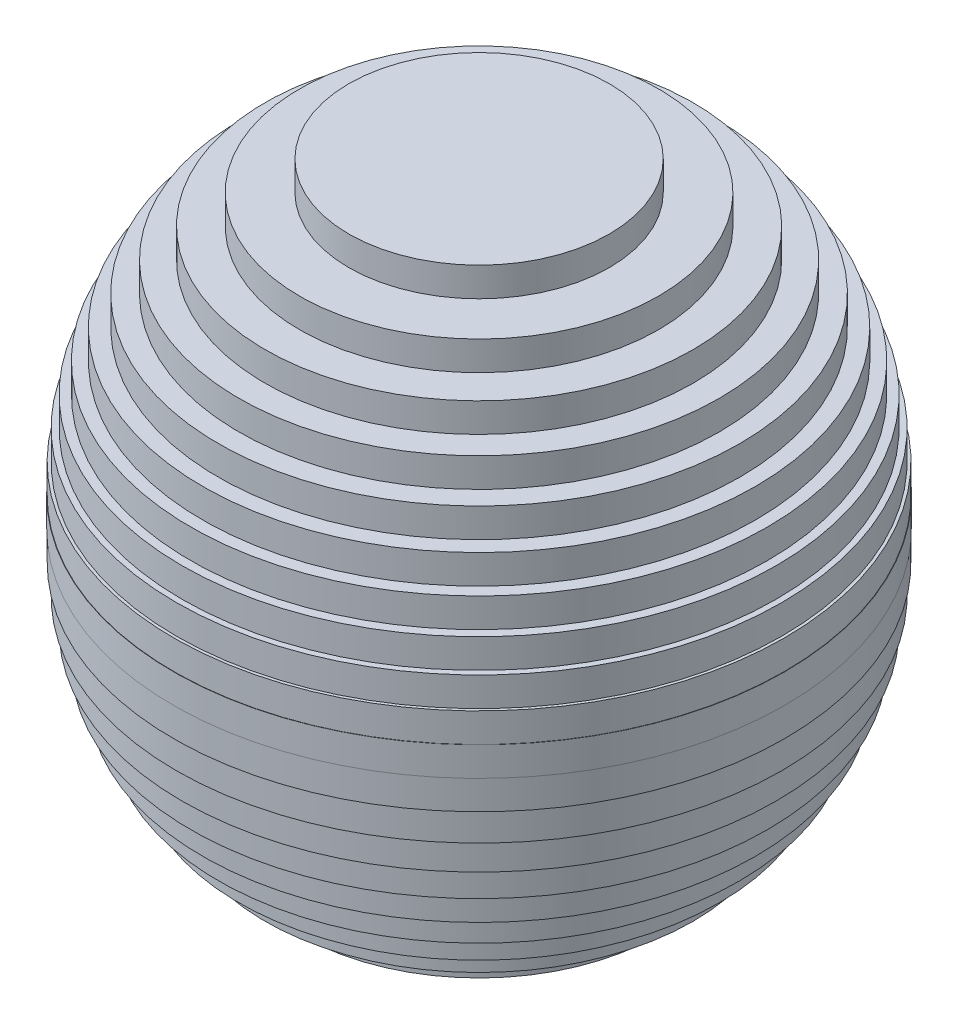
ISO-10303-21;
HEADER;
FILE_DESCRIPTION(('STEP AP214'),'2;1');
FILE_NAME('part.step','',(''),(''),'','','');
FILE_SCHEMA(('AUTOMOTIVE_DESIGN { 1 0 10303 214 1 1 1 1 }'));
ENDSEC;
DATA;
#1=APPLICATION_CONTEXT('core data for automotive mechanical design processes');
#2=APPLICATION_PROTOCOL_DEFINITION('international standard','automotive_design',2000,#1);
#3=PRODUCT_CONTEXT('',#1,'mechanical');
#4=PRODUCT('Part','Part','',(#3));
#5=PRODUCT_RELATED_PRODUCT_CATEGORY('part','',(#4));
#6=PRODUCT_DEFINITION_FORMATION('','',#4);
#7=PRODUCT_DEFINITION_CONTEXT('part definition',#1,'design');
#8=PRODUCT_DEFINITION('design','',#6,#7);
#9=PRODUCT_DEFINITION_SHAPE('','',#8);
#10=(LENGTH_UNIT() NAMED_UNIT(*) SI_UNIT(.MILLI.,.METRE.));
#11=(NAMED_UNIT(*) PLANE_ANGLE_UNIT() SI_UNIT($,.RADIAN.));
#12=(NAMED_UNIT(*) SI_UNIT($,.STERADIAN.) SOLID_ANGLE_UNIT());
#13=UNCERTAINTY_MEASURE_WITH_UNIT(LENGTH_MEASURE(1.E-05),#10,'distance_accuracy_value','');
#14=(GEOMETRIC_REPRESENTATION_CONTEXT(3) GLOBAL_UNCERTAINTY_ASSIGNED_CONTEXT((#13)) GLOBAL_UNIT_ASSIGNED_CONTEXT((#10,
#11,#12)) REPRESENTATION_CONTEXT('',''));
#15=CARTESIAN_POINT('',(0.,0.,0.));
#16=DIRECTION('',(0.,0.,1.));
#17=DIRECTION('',(1.,0.,0.));
#18=AXIS2_PLACEMENT_3D('',#15,#16,#17);
#19=CARTESIAN_POINT('',(52.4404424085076,2.49999999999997,0.));
#20=DIRECTION('',(0.,1.,0.));
#21=DIRECTION('',(-1.,0.,0.));
#22=AXIS2_PLACEMENT_3D('',#19,#20,#21);
#23=PLANE('',#22);
#24=CARTESIAN_POINT('',(0.,2.49999999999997,0.));
#25=DIRECTION('',(0.,-1.,0.));
#26=DIRECTION('',(1.,0.,0.));
#27=AXIS2_PLACEMENT_3D('',#24,#25,#26);
#28=CIRCLE('',#27,52.4404424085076);
#29=CARTESIAN_POINT('',(52.4404424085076,2.49999999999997,0.));
#30=VERTEX_POINT('',#29);
#31=EDGE_CURVE('E162',#30,#30,#28,.T.);
#32=ORIENTED_EDGE('',*,*,#31,.T.);
#33=EDGE_LOOP('',(#32));
#34=FACE_BOUND('',#33,.T.);
#35=CARTESIAN_POINT('',(0.,2.49999999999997,0.));
#36=DIRECTION('',(0.,-1.,0.));
#37=DIRECTION('',(1.,0.,0.));
#38=AXIS2_PLACEMENT_3D('',#35,#36,#37);
#39=CIRCLE('',#38,52.4999999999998);
#40=CARTESIAN_POINT('',(52.4999999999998,2.49999999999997,0.));
#41=VERTEX_POINT('',#40);
#42=EDGE_CURVE('E10',#41,#41,#39,.T.);
#43=ORIENTED_EDGE('',*,*,#42,.F.);
#44=EDGE_LOOP('',(#43));
#45=FACE_BOUND('',#44,.T.);
#46=ADVANCED_FACE('F32',(#34,#45),#23,.T.);
#47=CARTESIAN_POINT('',(0.,-52.5,0.));
#48=DIRECTION('',(0.,-1.,0.));
#49=DIRECTION('',(1.,0.,0.));
#50=AXIS2_PLACEMENT_3D('',#47,#48,#49);
#51=CYLINDRICAL_SURFACE('',#50,52.4999999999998);
#52=ORIENTED_EDGE('',*,*,#42,.T.);
#53=EDGE_LOOP('',(#52));
#54=FACE_BOUND('',#53,.T.);
#55=CARTESIAN_POINT('',(0.,-2.50000000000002,0.));
#56=DIRECTION('',(0.,-1.,0.));
#57=DIRECTION('',(1.,0.,0.));
#58=AXIS2_PLACEMENT_3D('',#55,#56,#57);
#59=CIRCLE('',#58,52.4999999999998);
#60=CARTESIAN_POINT('',(52.4999999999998,-2.50000000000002,0.));
#61=VERTEX_POINT('',#60);
#62=EDGE_CURVE('E38',#61,#61,#59,.T.);
#63=ORIENTED_EDGE('',*,*,#62,.F.);
#64=EDGE_LOOP('',(#63));
#65=FACE_BOUND('',#64,.T.);
#66=ADVANCED_FACE('F180',(#54,#65),#51,.T.);
#67=CARTESIAN_POINT('',(52.4999999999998,-2.50000000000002,0.));
#68=DIRECTION('',(0.,-1.,0.));
#69=DIRECTION('',(1.,0.,0.));
#70=AXIS2_PLACEMENT_3D('',#67,#68,#69);
#71=PLANE('',#70);
#72=ORIENTED_EDGE('',*,*,#62,.T.);
#73=EDGE_LOOP('',(#72));
#74=FACE_BOUND('',#73,.T.);
#75=CARTESIAN_POINT('',(0.,-2.50000000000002,0.));
#76=DIRECTION('',(0.,-1.,0.));
#77=DIRECTION('',(1.,0.,0.));
#78=AXIS2_PLACEMENT_3D('',#75,#76,#77);
#79=CIRCLE('',#78,52.4404424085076);
#80=CARTESIAN_POINT('',(52.4404424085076,-2.50000000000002,0.));
#81=VERTEX_POINT('',#80);
#82=EDGE_CURVE('E42',#81,#81,#79,.T.);
#83=ORIENTED_EDGE('',*,*,#82,.F.);
#84=EDGE_LOOP('',(#83));
#85=FACE_BOUND('',#84,.T.);
#86=ADVANCED_FACE('F184',(#74,#85),#71,.T.);
#87=CARTESIAN_POINT('',(0.,-52.5,0.));
#88=DIRECTION('',(0.,-1.,0.));
#89=DIRECTION('',(1.,0.,0.));
#90=AXIS2_PLACEMENT_3D('',#87,#88,#89);
#91=CYLINDRICAL_SURFACE('',#90,52.4404424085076);
#92=ORIENTED_EDGE('',*,*,#82,.T.);
#93=EDGE_LOOP('',(#92));
#94=FACE_BOUND('',#93,.T.);
#95=CARTESIAN_POINT('',(0.,-7.50000000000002,0.));
#96=DIRECTION('',(0.,-1.,0.));
#97=DIRECTION('',(1.,0.,0.));
#98=AXIS2_PLACEMENT_3D('',#95,#96,#97);
#99=CIRCLE('',#98,52.4404424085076);
#100=CARTESIAN_POINT('',(52.4404424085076,-7.50000000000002,0.));
#101=VERTEX_POINT('',#100);
#102=EDGE_CURVE('E46',#101,#101,#99,.T.);
#103=ORIENTED_EDGE('',*,*,#102,.F.);
#104=EDGE_LOOP('',(#103));
#105=FACE_BOUND('',#104,.T.);
#106=ADVANCED_FACE('F188',(#94,#105),#91,.T.);
#107=CARTESIAN_POINT('',(52.4404424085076,-7.50000000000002,0.));
#108=DIRECTION('',(0.,-1.,0.));
#109=DIRECTION('',(1.,0.,0.));
#110=AXIS2_PLACEMENT_3D('',#107,#108,#109);
#111=PLANE('',#110);
#112=ORIENTED_EDGE('',*,*,#102,.T.);
#113=EDGE_LOOP('',(#112));
#114=FACE_BOUND('',#113,.T.);
#115=CARTESIAN_POINT('',(0.,-7.50000000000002,0.));
#116=DIRECTION('',(0.,-1.,0.));
#117=DIRECTION('',(1.,0.,0.));
#118=AXIS2_PLACEMENT_3D('',#115,#116,#117);
#119=CIRCLE('',#118,51.9615242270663);
#120=CARTESIAN_POINT('',(51.9615242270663,-7.50000000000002,0.));
#121=VERTEX_POINT('',#120);
#122=EDGE_CURVE('E51',#121,#121,#119,.T.);
#123=ORIENTED_EDGE('',*,*,#122,.F.);
#124=EDGE_LOOP('',(#123));
#125=FACE_BOUND('',#124,.T.);
#126=ADVANCED_FACE('F194',(#114,#125),#111,.T.);
#127=CARTESIAN_POINT('',(0.,-52.5,0.));
#128=DIRECTION('',(0.,-1.,0.));
#129=DIRECTION('',(1.,0.,0.));
#130=AXIS2_PLACEMENT_3D('',#127,#128,#129);
#131=CYLINDRICAL_SURFACE('',#130,51.9615242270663);
#132=ORIENTED_EDGE('',*,*,#122,.T.);
#133=EDGE_LOOP('',(#132));
#134=FACE_BOUND('',#133,.T.);
#135=CARTESIAN_POINT('',(0.,-12.5,0.));
#136=DIRECTION('',(0.,-1.,0.));
#137=DIRECTION('',(1.,0.,0.));
#138=AXIS2_PLACEMENT_3D('',#135,#136,#137);
#139=CIRCLE('',#138,51.9615242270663);
#140=CARTESIAN_POINT('',(51.9615242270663,-12.5,0.));
#141=VERTEX_POINT('',#140);
#142=EDGE_CURVE('E54',#141,#141,#139,.T.);
#143=ORIENTED_EDGE('',*,*,#142,.F.);
#144=EDGE_LOOP('',(#143));
#145=FACE_BOUND('',#144,.T.);
#146=ADVANCED_FACE('F198',(#134,#145),#131,.T.);
#147=CARTESIAN_POINT('',(51.9615242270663,-12.5,0.));
#148=DIRECTION('',(0.,-1.,0.));
#149=DIRECTION('',(1.,0.,0.));
#150=AXIS2_PLACEMENT_3D('',#147,#148,#149);
#151=PLANE('',#150);
#152=ORIENTED_EDGE('',*,*,#142,.T.);
#153=EDGE_LOOP('',(#152));
#154=FACE_BOUND('',#153,.T.);
#155=CARTESIAN_POINT('',(0.,-12.5,0.));
#156=DIRECTION('',(0.,-1.,0.));
#157=DIRECTION('',(1.,0.,0.));
#158=AXIS2_PLACEMENT_3D('',#155,#156,#157);
#159=CIRCLE('',#158,50.9901951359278);
#160=CARTESIAN_POINT('',(50.9901951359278,-12.5,0.));
#161=VERTEX_POINT('',#160);
#162=EDGE_CURVE('E57',#161,#161,#159,.T.);
#163=ORIENTED_EDGE('',*,*,#162,.F.);
#164=EDGE_LOOP('',(#163));
#165=FACE_BOUND('',#164,.T.);
#166=ADVANCED_FACE('F202',(#154,#165),#151,.T.);
#167=CARTESIAN_POINT('',(0.,-52.5,0.));
#168=DIRECTION('',(0.,-1.,0.));
#169=DIRECTION('',(1.,0.,0.));
#170=AXIS2_PLACEMENT_3D('',#167,#168,#169);
#171=CYLINDRICAL_SURFACE('',#170,50.9901951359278);
#172=ORIENTED_EDGE('',*,*,#162,.T.);
#173=EDGE_LOOP('',(#172));
#174=FACE_BOUND('',#173,.T.);
#175=CARTESIAN_POINT('',(0.,-17.5,0.));
#176=DIRECTION('',(0.,-1.,0.));
#177=DIRECTION('',(1.,0.,0.));
#178=AXIS2_PLACEMENT_3D('',#175,#176,#177);
#179=CIRCLE('',#178,50.9901951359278);
#180=CARTESIAN_POINT('',(50.9901951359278,-17.5,0.));
#181=VERTEX_POINT('',#180);
#182=EDGE_CURVE('E60',#181,#181,#179,.T.);
#183=ORIENTED_EDGE('',*,*,#182,.F.);
#184=EDGE_LOOP('',(#183));
#185=FACE_BOUND('',#184,.T.);
#186=ADVANCED_FACE('F206',(#174,#185),#171,.T.);
#187=CARTESIAN_POINT('',(50.9901951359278,-17.5,0.));
#188=DIRECTION('',(0.,-1.,0.));
#189=DIRECTION('',(1.,0.,0.));
#190=AXIS2_PLACEMENT_3D('',#187,#188,#189);
#191=PLANE('',#190);
#192=ORIENTED_EDGE('',*,*,#182,.T.);
#193=EDGE_LOOP('',(#192));
#194=FACE_BOUND('',#193,.T.);
#195=CARTESIAN_POINT('',(0.,-17.5,0.));
#196=DIRECTION('',(0.,-1.,0.));
#197=DIRECTION('',(1.,0.,0.));
#198=AXIS2_PLACEMENT_3D('',#195,#196,#197);
#199=CIRCLE('',#198,49.4974746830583);
#200=CARTESIAN_POINT('',(49.4974746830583,-17.5,0.));
#201=VERTEX_POINT('',#200);
#202=EDGE_CURVE('E63',#201,#201,#199,.T.);
#203=ORIENTED_EDGE('',*,*,#202,.F.);
#204=EDGE_LOOP('',(#203));
#205=FACE_BOUND('',#204,.T.);
#206=ADVANCED_FACE('F210',(#194,#205),#191,.T.);
#207=CARTESIAN_POINT('',(0.,-52.5,0.));
#208=DIRECTION('',(0.,-1.,0.));
#209=DIRECTION('',(1.,0.,0.));
#210=AXIS2_PLACEMENT_3D('',#207,#208,#209);
#211=CYLINDRICAL_SURFACE('',#210,49.4974746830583);
#212=ORIENTED_EDGE('',*,*,#202,.T.);
#213=EDGE_LOOP('',(#212));
#214=FACE_BOUND('',#213,.T.);
#215=CARTESIAN_POINT('',(0.,-22.5,0.));
#216=DIRECTION('',(0.,-1.,0.));
#217=DIRECTION('',(1.,0.,0.));
#218=AXIS2_PLACEMENT_3D('',#215,#216,#217);
#219=CIRCLE('',#218,49.4974746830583);
#220=CARTESIAN_POINT('',(49.4974746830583,-22.5,0.));
#221=VERTEX_POINT('',#220);
#222=EDGE_CURVE('E66',#221,#221,#219,.T.);
#223=ORIENTED_EDGE('',*,*,#222,.F.);
#224=EDGE_LOOP('',(#223));
#225=FACE_BOUND('',#224,.T.);
#226=ADVANCED_FACE('F214',(#214,#225),#211,.T.);
#227=CARTESIAN_POINT('',(49.4974746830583,-22.5,0.));
#228=DIRECTION('',(0.,-1.,0.));
#229=DIRECTION('',(1.,0.,0.));
#230=AXIS2_PLACEMENT_3D('',#227,#228,#229);
#231=PLANE('',#230);
#232=ORIENTED_EDGE('',*,*,#222,.T.);
#233=EDGE_LOOP('',(#232));
#234=FACE_BOUND('',#233,.T.);
#235=CARTESIAN_POINT('',(0.,-22.5,0.));
#236=DIRECTION('',(0.,-1.,0.));
#237=DIRECTION('',(1.,0.,0.));
#238=AXIS2_PLACEMENT_3D('',#235,#236,#237);
#239=CIRCLE('',#238,47.4341649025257);
#240=CARTESIAN_POINT('',(47.4341649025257,-22.5,0.));
#241=VERTEX_POINT('',#240);
#242=EDGE_CURVE('E69',#241,#241,#239,.T.);
#243=ORIENTED_EDGE('',*,*,#242,.F.);
#244=EDGE_LOOP('',(#243));
#245=FACE_BOUND('',#244,.T.);
#246=ADVANCED_FACE('F218',(#234,#245),#231,.T.);
#247=CARTESIAN_POINT('',(0.,-52.5,0.));
#248=DIRECTION('',(0.,-1.,0.));
#249=DIRECTION('',(1.,0.,0.));
#250=AXIS2_PLACEMENT_3D('',#247,#248,#249);
#251=CYLINDRICAL_SURFACE('',#250,47.4341649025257);
#252=ORIENTED_EDGE('',*,*,#242,.T.);
#253=EDGE_LOOP('',(#252));
#254=FACE_BOUND('',#253,.T.);
#255=CARTESIAN_POINT('',(0.,-27.5,0.));
#256=DIRECTION('',(0.,-1.,0.));
#257=DIRECTION('',(1.,0.,0.));
#258=AXIS2_PLACEMENT_3D('',#255,#256,#257);
#259=CIRCLE('',#258,47.4341649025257);
#260=CARTESIAN_POINT('',(47.4341649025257,-27.5,0.));
#261=VERTEX_POINT('',#260);
#262=EDGE_CURVE('E72',#261,#261,#259,.T.);
#263=ORIENTED_EDGE('',*,*,#262,.F.);
#264=EDGE_LOOP('',(#263));
#265=FACE_BOUND('',#264,.T.);
#266=ADVANCED_FACE('F222',(#254,#265),#251,.T.);
#267=CARTESIAN_POINT('',(47.4341649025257,-27.5,0.));
#268=DIRECTION('',(0.,-1.,0.));
#269=DIRECTION('',(1.,0.,0.));
#270=AXIS2_PLACEMENT_3D('',#267,#268,#269);
#271=PLANE('',#270);
#272=ORIENTED_EDGE('',*,*,#262,.T.);
#273=EDGE_LOOP('',(#272));
#274=FACE_BOUND('',#273,.T.);
#275=CARTESIAN_POINT('',(0.,-27.5,0.));
#276=DIRECTION('',(0.,-1.,0.));
#277=DIRECTION('',(1.,0.,0.));
#278=AXIS2_PLACEMENT_3D('',#275,#276,#277);
#279=CIRCLE('',#278,44.7213595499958);
#280=CARTESIAN_POINT('',(44.7213595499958,-27.5,0.));
#281=VERTEX_POINT('',#280);
#282=EDGE_CURVE('E75',#281,#281,#279,.T.);
#283=ORIENTED_EDGE('',*,*,#282,.F.);
#284=EDGE_LOOP('',(#283));
#285=FACE_BOUND('',#284,.T.);
#286=ADVANCED_FACE('F226',(#274,#285),#271,.T.);
#287=CARTESIAN_POINT('',(0.,-52.5,0.));
#288=DIRECTION('',(0.,-1.,0.));
#289=DIRECTION('',(1.,0.,0.));
#290=AXIS2_PLACEMENT_3D('',#287,#288,#289);
#291=CYLINDRICAL_SURFACE('',#290,44.7213595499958);
#292=ORIENTED_EDGE('',*,*,#282,.T.);
#293=EDGE_LOOP('',(#292));
#294=FACE_BOUND('',#293,.T.);
#295=CARTESIAN_POINT('',(0.,-32.5,0.));
#296=DIRECTION('',(0.,-1.,0.));
#297=DIRECTION('',(1.,0.,0.));
#298=AXIS2_PLACEMENT_3D('',#295,#296,#297);
#299=CIRCLE('',#298,44.7213595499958);
#300=CARTESIAN_POINT('',(44.7213595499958,-32.5,0.));
#301=VERTEX_POINT('',#300);
#302=EDGE_CURVE('E78',#301,#301,#299,.T.);
#303=ORIENTED_EDGE('',*,*,#302,.F.);
#304=EDGE_LOOP('',(#303));
#305=FACE_BOUND('',#304,.T.);
#306=ADVANCED_FACE('F230',(#294,#305),#291,.T.);
#307=CARTESIAN_POINT('',(44.7213595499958,-32.5,0.));
#308=DIRECTION('',(0.,-1.,0.));
#309=DIRECTION('',(1.,0.,0.));
#310=AXIS2_PLACEMENT_3D('',#307,#308,#309);
#311=PLANE('',#310);
#312=ORIENTED_EDGE('',*,*,#302,.T.);
#313=EDGE_LOOP('',(#312));
#314=FACE_BOUND('',#313,.T.);
#315=CARTESIAN_POINT('',(0.,-32.5,0.));
#316=DIRECTION('',(0.,-1.,0.));
#317=DIRECTION('',(1.,0.,0.));
#318=AXIS2_PLACEMENT_3D('',#315,#316,#317);
#319=CIRCLE('',#318,41.2310562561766);
#320=CARTESIAN_POINT('',(41.2310562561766,-32.5,0.));
#321=VERTEX_POINT('',#320);
#322=EDGE_CURVE('E81',#321,#321,#319,.T.);
#323=ORIENTED_EDGE('',*,*,#322,.F.);
#324=EDGE_LOOP('',(#323));
#325=FACE_BOUND('',#324,.T.);
#326=ADVANCED_FACE('F234',(#314,#325),#311,.T.);
#327=CARTESIAN_POINT('',(0.,-52.5,0.));
#328=DIRECTION('',(0.,-1.,0.));
#329=DIRECTION('',(1.,0.,0.));
#330=AXIS2_PLACEMENT_3D('',#327,#328,#329);
#331=CYLINDRICAL_SURFACE('',#330,41.2310562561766);
#332=ORIENTED_EDGE('',*,*,#322,.T.);
#333=EDGE_LOOP('',(#332));
#334=FACE_BOUND('',#333,.T.);
#335=CARTESIAN_POINT('',(0.,-37.5,0.));
#336=DIRECTION('',(0.,-1.,0.));
#337=DIRECTION('',(1.,0.,0.));
#338=AXIS2_PLACEMENT_3D('',#335,#336,#337);
#339=CIRCLE('',#338,41.2310562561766);
#340=CARTESIAN_POINT('',(41.2310562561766,-37.5,0.));
#341=VERTEX_POINT('',#340);
#342=EDGE_CURVE('E84',#341,#341,#339,.T.);
#343=ORIENTED_EDGE('',*,*,#342,.F.);
#344=EDGE_LOOP('',(#343));
#345=FACE_BOUND('',#344,.T.);
#346=ADVANCED_FACE('F238',(#334,#345),#331,.T.);
#347=CARTESIAN_POINT('',(41.2310562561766,-37.5,0.));
#348=DIRECTION('',(0.,-1.,0.));
#349=DIRECTION('',(1.,0.,0.));
#350=AXIS2_PLACEMENT_3D('',#347,#348,#349);
#351=PLANE('',#350);
#352=ORIENTED_EDGE('',*,*,#342,.T.);
#353=EDGE_LOOP('',(#352));
#354=FACE_BOUND('',#353,.T.);
#355=CARTESIAN_POINT('',(0.,-37.5,0.));
#356=DIRECTION('',(0.,-1.,0.));
#357=DIRECTION('',(1.,0.,0.));
#358=AXIS2_PLACEMENT_3D('',#355,#356,#357);
#359=CIRCLE('',#358,36.7423461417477);
#360=CARTESIAN_POINT('',(36.7423461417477,-37.5,0.));
#361=VERTEX_POINT('',#360);
#362=EDGE_CURVE('E87',#361,#361,#359,.T.);
#363=ORIENTED_EDGE('',*,*,#362,.F.);
#364=EDGE_LOOP('',(#363));
#365=FACE_BOUND('',#364,.T.);
#366=ADVANCED_FACE('F242',(#354,#365),#351,.T.);
#367=CARTESIAN_POINT('',(0.,-52.5,0.));
#368=DIRECTION('',(0.,-1.,0.));
#369=DIRECTION('',(1.,0.,0.));
#370=AXIS2_PLACEMENT_3D('',#367,#368,#369);
#371=CYLINDRICAL_SURFACE('',#370,36.7423461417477);
#372=ORIENTED_EDGE('',*,*,#362,.T.);
#373=EDGE_LOOP('',(#372));
#374=FACE_BOUND('',#373,.T.);
#375=CARTESIAN_POINT('',(0.,-42.5,0.));
#376=DIRECTION('',(0.,-1.,0.));
#377=DIRECTION('',(1.,0.,0.));
#378=AXIS2_PLACEMENT_3D('',#375,#376,#377);
#379=CIRCLE('',#378,36.7423461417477);
#380=CARTESIAN_POINT('',(36.7423461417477,-42.5,0.));
#381=VERTEX_POINT('',#380);
#382=EDGE_CURVE('E90',#381,#381,#379,.T.);
#383=ORIENTED_EDGE('',*,*,#382,.F.);
#384=EDGE_LOOP('',(#383));
#385=FACE_BOUND('',#384,.T.);
#386=ADVANCED_FACE('F246',(#374,#385),#371,.T.);
#387=CARTESIAN_POINT('',(36.7423461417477,-42.5,0.));
#388=DIRECTION('',(0.,-1.,0.));
#389=DIRECTION('',(1.,0.,0.));
#390=AXIS2_PLACEMENT_3D('',#387,#388,#389);
#391=PLANE('',#390);
#392=ORIENTED_EDGE('',*,*,#382,.T.);
#393=EDGE_LOOP('',(#392));
#394=FACE_BOUND('',#393,.T.);
#395=CARTESIAN_POINT('',(0.,-42.5,0.));
#396=DIRECTION('',(0.,-1.,0.));
#397=DIRECTION('',(1.,0.,0.));
#398=AXIS2_PLACEMENT_3D('',#395,#396,#397);
#399=CIRCLE('',#398,30.8220700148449);
#400=CARTESIAN_POINT('',(30.8220700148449,-42.5,0.));
#401=VERTEX_POINT('',#400);
#402=EDGE_CURVE('E93',#401,#401,#399,.T.);
#403=ORIENTED_EDGE('',*,*,#402,.F.);
#404=EDGE_LOOP('',(#403));
#405=FACE_BOUND('',#404,.T.);
#406=ADVANCED_FACE('F250',(#394,#405),#391,.T.);
#407=CARTESIAN_POINT('',(0.,-52.5,0.));
#408=DIRECTION('',(0.,-1.,0.));
#409=DIRECTION('',(1.,0.,0.));
#410=AXIS2_PLACEMENT_3D('',#407,#408,#409);
#411=CYLINDRICAL_SURFACE('',#410,30.8220700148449);
#412=ORIENTED_EDGE('',*,*,#402,.T.);
#413=EDGE_LOOP('',(#412));
#414=FACE_BOUND('',#413,.T.);
#415=CARTESIAN_POINT('',(0.,-47.5,0.));
#416=DIRECTION('',(0.,-1.,0.));
#417=DIRECTION('',(1.,0.,0.));
#418=AXIS2_PLACEMENT_3D('',#415,#416,#417);
#419=CIRCLE('',#418,30.8220700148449);
#420=CARTESIAN_POINT('',(30.8220700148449,-47.5,0.));
#421=VERTEX_POINT('',#420);
#422=EDGE_CURVE('E96',#421,#421,#419,.T.);
#423=ORIENTED_EDGE('',*,*,#422,.F.);
#424=EDGE_LOOP('',(#423));
#425=FACE_BOUND('',#424,.T.);
#426=ADVANCED_FACE('F254',(#414,#425),#411,.T.);
#427=CARTESIAN_POINT('',(30.8220700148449,-47.5,0.));
#428=DIRECTION('',(0.,-1.,0.));
#429=DIRECTION('',(1.,0.,0.));
#430=AXIS2_PLACEMENT_3D('',#427,#428,#429);
#431=PLANE('',#430);
#432=ORIENTED_EDGE('',*,*,#422,.T.);
#433=EDGE_LOOP('',(#432));
#434=FACE_BOUND('',#433,.T.);
#435=CARTESIAN_POINT('',(0.,-47.5,0.));
#436=DIRECTION('',(0.,-1.,0.));
#437=DIRECTION('',(1.,0.,0.));
#438=AXIS2_PLACEMENT_3D('',#435,#436,#437);
#439=CIRCLE('',#438,22.3606797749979);
#440=CARTESIAN_POINT('',(22.3606797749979,-47.5,0.));
#441=VERTEX_POINT('',#440);
#442=EDGE_CURVE('E99',#441,#441,#439,.T.);
#443=ORIENTED_EDGE('',*,*,#442,.F.);
#444=EDGE_LOOP('',(#443));
#445=FACE_BOUND('',#444,.T.);
#446=ADVANCED_FACE('F258',(#434,#445),#431,.T.);
#447=CARTESIAN_POINT('',(0.,-52.5,0.));
#448=DIRECTION('',(0.,-1.,0.));
#449=DIRECTION('',(1.,0.,0.));
#450=AXIS2_PLACEMENT_3D('',#447,#448,#449);
#451=CYLINDRICAL_SURFACE('',#450,22.3606797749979);
#452=ORIENTED_EDGE('',*,*,#442,.T.);
#453=EDGE_LOOP('',(#452));
#454=FACE_BOUND('',#453,.T.);
#455=CARTESIAN_POINT('',(0.,-52.5,0.));
#456=DIRECTION('',(0.,-1.,0.));
#457=DIRECTION('',(1.,0.,0.));
#458=AXIS2_PLACEMENT_3D('',#455,#456,#457);
#459=CIRCLE('',#458,22.3606797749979);
#460=CARTESIAN_POINT('',(22.3606797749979,-52.5,0.));
#461=VERTEX_POINT('',#460);
#462=EDGE_CURVE('E102',#461,#461,#459,.T.);
#463=ORIENTED_EDGE('',*,*,#462,.F.);
#464=EDGE_LOOP('',(#463));
#465=FACE_BOUND('',#464,.T.);
#466=ADVANCED_FACE('F262',(#454,#465),#451,.T.);
#467=CARTESIAN_POINT('',(22.3606797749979,-52.5,0.));
#468=DIRECTION('',(0.,-1.,0.));
#469=DIRECTION('',(1.,0.,0.));
#470=AXIS2_PLACEMENT_3D('',#467,#468,#469);
#471=PLANE('',#470);
#472=ORIENTED_EDGE('',*,*,#462,.T.);
#473=EDGE_LOOP('',(#472));
#474=FACE_BOUND('',#473,.T.);
#475=ADVANCED_FACE('F266',(#474),#471,.T.);
#476=CARTESIAN_POINT('',(0.,52.5,0.));
#477=DIRECTION('',(0.,1.,0.));
#478=DIRECTION('',(-1.,0.,0.));
#479=AXIS2_PLACEMENT_3D('',#476,#477,#478);
#480=PLANE('',#479);
#481=CARTESIAN_POINT('',(0.,52.5,0.));
#482=DIRECTION('',(0.,-1.,0.));
#483=DIRECTION('',(1.,0.,0.));
#484=AXIS2_PLACEMENT_3D('',#481,#482,#483);
#485=CIRCLE('',#484,22.3606797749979);
#486=CARTESIAN_POINT('',(22.3606797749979,52.5,0.));
#487=VERTEX_POINT('',#486);
#488=EDGE_CURVE('E105',#487,#487,#485,.T.);
#489=ORIENTED_EDGE('',*,*,#488,.F.);
#490=EDGE_LOOP('',(#489));
#491=FACE_BOUND('',#490,.T.);
#492=ADVANCED_FACE('F270',(#491),#480,.T.);
#493=CARTESIAN_POINT('',(0.,-52.5,0.));
#494=DIRECTION('',(0.,-1.,0.));
#495=DIRECTION('',(1.,0.,0.));
#496=AXIS2_PLACEMENT_3D('',#493,#494,#495);
#497=CYLINDRICAL_SURFACE('',#496,22.3606797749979);
#498=ORIENTED_EDGE('',*,*,#488,.T.);
#499=EDGE_LOOP('',(#498));
#500=FACE_BOUND('',#499,.T.);
#501=CARTESIAN_POINT('',(0.,47.5,0.));
#502=DIRECTION('',(0.,-1.,0.));
#503=DIRECTION('',(1.,0.,0.));
#504=AXIS2_PLACEMENT_3D('',#501,#502,#503);
#505=CIRCLE('',#504,22.360679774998);
#506=CARTESIAN_POINT('',(22.360679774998,47.5,0.));
#507=VERTEX_POINT('',#506);
#508=EDGE_CURVE('E108',#507,#507,#505,.T.);
#509=ORIENTED_EDGE('',*,*,#508,.F.);
#510=EDGE_LOOP('',(#509));
#511=FACE_BOUND('',#510,.T.);
#512=ADVANCED_FACE('F274',(#500,#511),#497,.T.);
#513=CARTESIAN_POINT('',(22.360679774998,47.5,0.));
#514=DIRECTION('',(0.,1.,0.));
#515=DIRECTION('',(-1.,0.,0.));
#516=AXIS2_PLACEMENT_3D('',#513,#514,#515);
#517=PLANE('',#516);
#518=ORIENTED_EDGE('',*,*,#508,.T.);
#519=EDGE_LOOP('',(#518));
#520=FACE_BOUND('',#519,.T.);
#521=CARTESIAN_POINT('',(0.,47.5,0.));
#522=DIRECTION('',(0.,-1.,0.));
#523=DIRECTION('',(1.,0.,0.));
#524=AXIS2_PLACEMENT_3D('',#521,#522,#523);
#525=CIRCLE('',#524,30.8220700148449);
#526=CARTESIAN_POINT('',(30.8220700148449,47.5,0.));
#527=VERTEX_POINT('',#526);
#528=EDGE_CURVE('E111',#527,#527,#525,.T.);
#529=ORIENTED_EDGE('',*,*,#528,.F.);
#530=EDGE_LOOP('',(#529));
#531=FACE_BOUND('',#530,.T.);
#532=ADVANCED_FACE('F278',(#520,#531),#517,.T.);
#533=CARTESIAN_POINT('',(0.,-52.5,0.));
#534=DIRECTION('',(0.,-1.,0.));
#535=DIRECTION('',(1.,0.,0.));
#536=AXIS2_PLACEMENT_3D('',#533,#534,#535);
#537=CYLINDRICAL_SURFACE('',#536,30.8220700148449);
#538=ORIENTED_EDGE('',*,*,#528,.T.);
#539=EDGE_LOOP('',(#538));
#540=FACE_BOUND('',#539,.T.);
#541=CARTESIAN_POINT('',(0.,42.5,0.));
#542=DIRECTION('',(0.,-1.,0.));
#543=DIRECTION('',(1.,0.,0.));
#544=AXIS2_PLACEMENT_3D('',#541,#542,#543);
#545=CIRCLE('',#544,30.8220700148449);
#546=CARTESIAN_POINT('',(30.8220700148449,42.5,0.));
#547=VERTEX_POINT('',#546);
#548=EDGE_CURVE('E114',#547,#547,#545,.T.);
#549=ORIENTED_EDGE('',*,*,#548,.F.);
#550=EDGE_LOOP('',(#549));
#551=FACE_BOUND('',#550,.T.);
#552=ADVANCED_FACE('F282',(#540,#551),#537,.T.);
#553=CARTESIAN_POINT('',(30.8220700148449,42.5,0.));
#554=DIRECTION('',(0.,1.,0.));
#555=DIRECTION('',(-1.,0.,0.));
#556=AXIS2_PLACEMENT_3D('',#553,#554,#555);
#557=PLANE('',#556);
#558=ORIENTED_EDGE('',*,*,#548,.T.);
#559=EDGE_LOOP('',(#558));
#560=FACE_BOUND('',#559,.T.);
#561=CARTESIAN_POINT('',(0.,42.5,0.));
#562=DIRECTION('',(0.,-1.,0.));
#563=DIRECTION('',(1.,0.,0.));
#564=AXIS2_PLACEMENT_3D('',#561,#562,#563);
#565=CIRCLE('',#564,36.7423461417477);
#566=CARTESIAN_POINT('',(36.7423461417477,42.5,0.));
#567=VERTEX_POINT('',#566);
#568=EDGE_CURVE('E117',#567,#567,#565,.T.);
#569=ORIENTED_EDGE('',*,*,#568,.F.);
#570=EDGE_LOOP('',(#569));
#571=FACE_BOUND('',#570,.T.);
#572=ADVANCED_FACE('F286',(#560,#571),#557,.T.);
#573=CARTESIAN_POINT('',(0.,-52.5,0.));
#574=DIRECTION('',(0.,-1.,0.));
#575=DIRECTION('',(1.,0.,0.));
#576=AXIS2_PLACEMENT_3D('',#573,#574,#575);
#577=CYLINDRICAL_SURFACE('',#576,36.7423461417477);
#578=ORIENTED_EDGE('',*,*,#568,.T.);
#579=EDGE_LOOP('',(#578));
#580=FACE_BOUND('',#579,.T.);
#581=CARTESIAN_POINT('',(0.,37.5,0.));
#582=DIRECTION('',(0.,-1.,0.));
#583=DIRECTION('',(1.,0.,0.));
#584=AXIS2_PLACEMENT_3D('',#581,#582,#583);
#585=CIRCLE('',#584,36.7423461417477);
#586=CARTESIAN_POINT('',(36.7423461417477,37.5,0.));
#587=VERTEX_POINT('',#586);
#588=EDGE_CURVE('E120',#587,#587,#585,.T.);
#589=ORIENTED_EDGE('',*,*,#588,.F.);
#590=EDGE_LOOP('',(#589));
#591=FACE_BOUND('',#590,.T.);
#592=ADVANCED_FACE('F290',(#580,#591),#577,.T.);
#593=CARTESIAN_POINT('',(36.7423461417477,37.5,0.));
#594=DIRECTION('',(0.,1.,0.));
#595=DIRECTION('',(-1.,0.,0.));
#596=AXIS2_PLACEMENT_3D('',#593,#594,#595);
#597=PLANE('',#596);
#598=ORIENTED_EDGE('',*,*,#588,.T.);
#599=EDGE_LOOP('',(#598));
#600=FACE_BOUND('',#599,.T.);
#601=CARTESIAN_POINT('',(0.,37.5,0.));
#602=DIRECTION('',(0.,-1.,0.));
#603=DIRECTION('',(1.,0.,0.));
#604=AXIS2_PLACEMENT_3D('',#601,#602,#603);
#605=CIRCLE('',#604,41.2310562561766);
#606=CARTESIAN_POINT('',(41.2310562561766,37.5,0.));
#607=VERTEX_POINT('',#606);
#608=EDGE_CURVE('E123',#607,#607,#605,.T.);
#609=ORIENTED_EDGE('',*,*,#608,.F.);
#610=EDGE_LOOP('',(#609));
#611=FACE_BOUND('',#610,.T.);
#612=ADVANCED_FACE('F294',(#600,#611),#597,.T.);
#613=CARTESIAN_POINT('',(0.,-52.5,0.));
#614=DIRECTION('',(0.,-1.,0.));
#615=DIRECTION('',(1.,0.,0.));
#616=AXIS2_PLACEMENT_3D('',#613,#614,#615);
#617=CYLINDRICAL_SURFACE('',#616,41.2310562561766);
#618=ORIENTED_EDGE('',*,*,#608,.T.);
#619=EDGE_LOOP('',(#618));
#620=FACE_BOUND('',#619,.T.);
#621=CARTESIAN_POINT('',(0.,32.5,0.));
#622=DIRECTION('',(0.,-1.,0.));
#623=DIRECTION('',(1.,0.,0.));
#624=AXIS2_PLACEMENT_3D('',#621,#622,#623);
#625=CIRCLE('',#624,41.2310562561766);
#626=CARTESIAN_POINT('',(41.2310562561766,32.5,0.));
#627=VERTEX_POINT('',#626);
#628=EDGE_CURVE('E126',#627,#627,#625,.T.);
#629=ORIENTED_EDGE('',*,*,#628,.F.);
#630=EDGE_LOOP('',(#629));
#631=FACE_BOUND('',#630,.T.);
#632=ADVANCED_FACE('F298',(#620,#631),#617,.T.);
#633=CARTESIAN_POINT('',(41.2310562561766,32.5,0.));
#634=DIRECTION('',(0.,1.,0.));
#635=DIRECTION('',(-1.,0.,0.));
#636=AXIS2_PLACEMENT_3D('',#633,#634,#635);
#637=PLANE('',#636);
#638=ORIENTED_EDGE('',*,*,#628,.T.);
#639=EDGE_LOOP('',(#638));
#640=FACE_BOUND('',#639,.T.);
#641=CARTESIAN_POINT('',(0.,32.5,0.));
#642=DIRECTION('',(0.,-1.,0.));
#643=DIRECTION('',(1.,0.,0.));
#644=AXIS2_PLACEMENT_3D('',#641,#642,#643);
#645=CIRCLE('',#644,44.7213595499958);
#646=CARTESIAN_POINT('',(44.7213595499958,32.5,0.));
#647=VERTEX_POINT('',#646);
#648=EDGE_CURVE('E129',#647,#647,#645,.T.);
#649=ORIENTED_EDGE('',*,*,#648,.F.);
#650=EDGE_LOOP('',(#649));
#651=FACE_BOUND('',#650,.T.);
#652=ADVANCED_FACE('F302',(#640,#651),#637,.T.);
#653=CARTESIAN_POINT('',(0.,-52.5,0.));
#654=DIRECTION('',(0.,-1.,0.));
#655=DIRECTION('',(1.,0.,0.));
#656=AXIS2_PLACEMENT_3D('',#653,#654,#655);
#657=CYLINDRICAL_SURFACE('',#656,44.7213595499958);
#658=ORIENTED_EDGE('',*,*,#648,.T.);
#659=EDGE_LOOP('',(#658));
#660=FACE_BOUND('',#659,.T.);
#661=CARTESIAN_POINT('',(0.,27.5,0.));
#662=DIRECTION('',(0.,-1.,0.));
#663=DIRECTION('',(1.,0.,0.));
#664=AXIS2_PLACEMENT_3D('',#661,#662,#663);
#665=CIRCLE('',#664,44.7213595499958);
#666=CARTESIAN_POINT('',(44.7213595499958,27.5,0.));
#667=VERTEX_POINT('',#666);
#668=EDGE_CURVE('E132',#667,#667,#665,.T.);
#669=ORIENTED_EDGE('',*,*,#668,.F.);
#670=EDGE_LOOP('',(#669));
#671=FACE_BOUND('',#670,.T.);
#672=ADVANCED_FACE('F306',(#660,#671),#657,.T.);
#673=CARTESIAN_POINT('',(44.7213595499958,27.5,0.));
#674=DIRECTION('',(0.,1.,0.));
#675=DIRECTION('',(-1.,0.,0.));
#676=AXIS2_PLACEMENT_3D('',#673,#674,#675);
#677=PLANE('',#676);
#678=ORIENTED_EDGE('',*,*,#668,.T.);
#679=EDGE_LOOP('',(#678));
#680=FACE_BOUND('',#679,.T.);
#681=CARTESIAN_POINT('',(0.,27.5,0.));
#682=DIRECTION('',(0.,-1.,0.));
#683=DIRECTION('',(1.,0.,0.));
#684=AXIS2_PLACEMENT_3D('',#681,#682,#683);
#685=CIRCLE('',#684,47.4341649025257);
#686=CARTESIAN_POINT('',(47.4341649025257,27.5,0.));
#687=VERTEX_POINT('',#686);
#688=EDGE_CURVE('E135',#687,#687,#685,.T.);
#689=ORIENTED_EDGE('',*,*,#688,.F.);
#690=EDGE_LOOP('',(#689));
#691=FACE_BOUND('',#690,.T.);
#692=ADVANCED_FACE('F310',(#680,#691),#677,.T.);
#693=CARTESIAN_POINT('',(0.,-52.5,0.));
#694=DIRECTION('',(0.,-1.,0.));
#695=DIRECTION('',(1.,0.,0.));
#696=AXIS2_PLACEMENT_3D('',#693,#694,#695);
#697=CYLINDRICAL_SURFACE('',#696,47.4341649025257);
#698=ORIENTED_EDGE('',*,*,#688,.T.);
#699=EDGE_LOOP('',(#698));
#700=FACE_BOUND('',#699,.T.);
#701=CARTESIAN_POINT('',(0.,22.5,0.));
#702=DIRECTION('',(0.,-1.,0.));
#703=DIRECTION('',(1.,0.,0.));
#704=AXIS2_PLACEMENT_3D('',#701,#702,#703);
#705=CIRCLE('',#704,47.4341649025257);
#706=CARTESIAN_POINT('',(47.4341649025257,22.5,0.));
#707=VERTEX_POINT('',#706);
#708=EDGE_CURVE('E138',#707,#707,#705,.T.);
#709=ORIENTED_EDGE('',*,*,#708,.F.);
#710=EDGE_LOOP('',(#709));
#711=FACE_BOUND('',#710,.T.);
#712=ADVANCED_FACE('F314',(#700,#711),#697,.T.);
#713=CARTESIAN_POINT('',(47.4341649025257,22.5,0.));
#714=DIRECTION('',(0.,1.,0.));
#715=DIRECTION('',(-1.,0.,0.));
#716=AXIS2_PLACEMENT_3D('',#713,#714,#715);
#717=PLANE('',#716);
#718=ORIENTED_EDGE('',*,*,#708,.T.);
#719=EDGE_LOOP('',(#718));
#720=FACE_BOUND('',#719,.T.);
#721=CARTESIAN_POINT('',(0.,22.5,0.));
#722=DIRECTION('',(0.,-1.,0.));
#723=DIRECTION('',(1.,0.,0.));
#724=AXIS2_PLACEMENT_3D('',#721,#722,#723);
#725=CIRCLE('',#724,49.4974746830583);
#726=CARTESIAN_POINT('',(49.4974746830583,22.5,0.));
#727=VERTEX_POINT('',#726);
#728=EDGE_CURVE('E141',#727,#727,#725,.T.);
#729=ORIENTED_EDGE('',*,*,#728,.F.);
#730=EDGE_LOOP('',(#729));
#731=FACE_BOUND('',#730,.T.);
#732=ADVANCED_FACE('F318',(#720,#731),#717,.T.);
#733=CARTESIAN_POINT('',(0.,-52.5,0.));
#734=DIRECTION('',(0.,-1.,0.));
#735=DIRECTION('',(1.,0.,0.));
#736=AXIS2_PLACEMENT_3D('',#733,#734,#735);
#737=CYLINDRICAL_SURFACE('',#736,49.4974746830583);
#738=ORIENTED_EDGE('',*,*,#728,.T.);
#739=EDGE_LOOP('',(#738));
#740=FACE_BOUND('',#739,.T.);
#741=CARTESIAN_POINT('',(0.,17.5,0.));
#742=DIRECTION('',(0.,-1.,0.));
#743=DIRECTION('',(1.,0.,0.));
#744=AXIS2_PLACEMENT_3D('',#741,#742,#743);
#745=CIRCLE('',#744,49.4974746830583);
#746=CARTESIAN_POINT('',(49.4974746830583,17.5,0.));
#747=VERTEX_POINT('',#746);
#748=EDGE_CURVE('E144',#747,#747,#745,.T.);
#749=ORIENTED_EDGE('',*,*,#748,.F.);
#750=EDGE_LOOP('',(#749));
#751=FACE_BOUND('',#750,.T.);
#752=ADVANCED_FACE('F322',(#740,#751),#737,.T.);
#753=CARTESIAN_POINT('',(49.4974746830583,17.5,0.));
#754=DIRECTION('',(0.,1.,0.));
#755=DIRECTION('',(-1.,0.,0.));
#756=AXIS2_PLACEMENT_3D('',#753,#754,#755);
#757=PLANE('',#756);
#758=ORIENTED_EDGE('',*,*,#748,.T.);
#759=EDGE_LOOP('',(#758));
#760=FACE_BOUND('',#759,.T.);
#761=CARTESIAN_POINT('',(0.,17.5,0.));
#762=DIRECTION('',(0.,-1.,0.));
#763=DIRECTION('',(1.,0.,0.));
#764=AXIS2_PLACEMENT_3D('',#761,#762,#763);
#765=CIRCLE('',#764,50.9901951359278);
#766=CARTESIAN_POINT('',(50.9901951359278,17.5,0.));
#767=VERTEX_POINT('',#766);
#768=EDGE_CURVE('E147',#767,#767,#765,.T.);
#769=ORIENTED_EDGE('',*,*,#768,.F.);
#770=EDGE_LOOP('',(#769));
#771=FACE_BOUND('',#770,.T.);
#772=ADVANCED_FACE('F326',(#760,#771),#757,.T.);
#773=CARTESIAN_POINT('',(0.,-52.5,0.));
#774=DIRECTION('',(0.,-1.,0.));
#775=DIRECTION('',(1.,0.,0.));
#776=AXIS2_PLACEMENT_3D('',#773,#774,#775);
#777=CYLINDRICAL_SURFACE('',#776,50.9901951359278);
#778=ORIENTED_EDGE('',*,*,#768,.T.);
#779=EDGE_LOOP('',(#778));
#780=FACE_BOUND('',#779,.T.);
#781=CARTESIAN_POINT('',(0.,12.5,0.));
#782=DIRECTION('',(0.,-1.,0.));
#783=DIRECTION('',(1.,0.,0.));
#784=AXIS2_PLACEMENT_3D('',#781,#782,#783);
#785=CIRCLE('',#784,50.9901951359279);
#786=CARTESIAN_POINT('',(50.9901951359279,12.5,0.));
#787=VERTEX_POINT('',#786);
#788=EDGE_CURVE('E150',#787,#787,#785,.T.);
#789=ORIENTED_EDGE('',*,*,#788,.F.);
#790=EDGE_LOOP('',(#789));
#791=FACE_BOUND('',#790,.T.);
#792=ADVANCED_FACE('F330',(#780,#791),#777,.T.);
#793=CARTESIAN_POINT('',(50.9901951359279,12.5,0.));
#794=DIRECTION('',(0.,1.,0.));
#795=DIRECTION('',(-1.,0.,0.));
#796=AXIS2_PLACEMENT_3D('',#793,#794,#795);
#797=PLANE('',#796);
#798=ORIENTED_EDGE('',*,*,#788,.T.);
#799=EDGE_LOOP('',(#798));
#800=FACE_BOUND('',#799,.T.);
#801=CARTESIAN_POINT('',(0.,12.5,0.));
#802=DIRECTION('',(0.,-1.,0.));
#803=DIRECTION('',(1.,0.,0.));
#804=AXIS2_PLACEMENT_3D('',#801,#802,#803);
#805=CIRCLE('',#804,51.9615242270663);
#806=CARTESIAN_POINT('',(51.9615242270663,12.5,0.));
#807=VERTEX_POINT('',#806);
#808=EDGE_CURVE('E153',#807,#807,#805,.T.);
#809=ORIENTED_EDGE('',*,*,#808,.F.);
#810=EDGE_LOOP('',(#809));
#811=FACE_BOUND('',#810,.T.);
#812=ADVANCED_FACE('F334',(#800,#811),#797,.T.);
#813=CARTESIAN_POINT('',(0.,-52.5,0.));
#814=DIRECTION('',(0.,-1.,0.));
#815=DIRECTION('',(1.,0.,0.));
#816=AXIS2_PLACEMENT_3D('',#813,#814,#815);
#817=CYLINDRICAL_SURFACE('',#816,51.9615242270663);
#818=ORIENTED_EDGE('',*,*,#808,.T.);
#819=EDGE_LOOP('',(#818));
#820=FACE_BOUND('',#819,.T.);
#821=CARTESIAN_POINT('',(0.,7.49999999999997,0.));
#822=DIRECTION('',(0.,-1.,0.));
#823=DIRECTION('',(1.,0.,0.));
#824=AXIS2_PLACEMENT_3D('',#821,#822,#823);
#825=CIRCLE('',#824,51.9615242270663);
#826=CARTESIAN_POINT('',(51.9615242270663,7.49999999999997,0.));
#827=VERTEX_POINT('',#826);
#828=EDGE_CURVE('E156',#827,#827,#825,.T.);
#829=ORIENTED_EDGE('',*,*,#828,.F.);
#830=EDGE_LOOP('',(#829));
#831=FACE_BOUND('',#830,.T.);
#832=ADVANCED_FACE('F176',(#820,#831),#817,.T.);
#833=CARTESIAN_POINT('',(51.9615242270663,7.49999999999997,0.));
#834=DIRECTION('',(0.,1.,0.));
#835=DIRECTION('',(-1.,0.,0.));
#836=AXIS2_PLACEMENT_3D('',#833,#834,#835);
#837=PLANE('',#836);
#838=ORIENTED_EDGE('',*,*,#828,.T.);
#839=EDGE_LOOP('',(#838));
#840=FACE_BOUND('',#839,.T.);
#841=CARTESIAN_POINT('',(0.,7.49999999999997,0.));
#842=DIRECTION('',(0.,-1.,0.));
#843=DIRECTION('',(1.,0.,0.));
#844=AXIS2_PLACEMENT_3D('',#841,#842,#843);
#845=CIRCLE('',#844,52.4404424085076);
#846=CARTESIAN_POINT('',(52.4404424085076,7.49999999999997,0.));
#847=VERTEX_POINT('',#846);
#848=EDGE_CURVE('E159',#847,#847,#845,.T.);
#849=ORIENTED_EDGE('',*,*,#848,.F.);
#850=EDGE_LOOP('',(#849));
#851=FACE_BOUND('',#850,.T.);
#852=ADVANCED_FACE('F170',(#840,#851),#837,.T.);
#853=CARTESIAN_POINT('',(0.,-52.5,0.));
#854=DIRECTION('',(0.,-1.,0.));
#855=DIRECTION('',(1.,0.,0.));
#856=AXIS2_PLACEMENT_3D('',#853,#854,#855);
#857=CYLINDRICAL_SURFACE('',#856,52.4404424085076);
#858=ORIENTED_EDGE('',*,*,#848,.T.);
#859=EDGE_LOOP('',(#858));
#860=FACE_BOUND('',#859,.T.);
#861=ORIENTED_EDGE('',*,*,#31,.F.);
#862=EDGE_LOOP('',(#861));
#863=FACE_BOUND('',#862,.T.);
#864=ADVANCED_FACE('F168',(#860,#863),#857,.T.);
#865=CLOSED_SHELL('',(#46,#66,#86,#106,#126,#146,#166,#186,#206,#226,#246,#266,#286,#306,#326,
#346,#366,#386,#406,#426,#446,#466,#475,#492,#512,#532,#552,#572,#592,#612,#632,#652,#672,#692,
#712,#732,#752,#772,#792,#812,#832,#852,#864));
#866=MANIFOLD_SOLID_BREP('B2',#865);
#867=ADVANCED_BREP_SHAPE_REPRESENTATION('',(#18,#866),#14);
#868=SHAPE_DEFINITION_REPRESENTATION(#9,#867);
ENDSEC;
END-ISO-10303-21;
